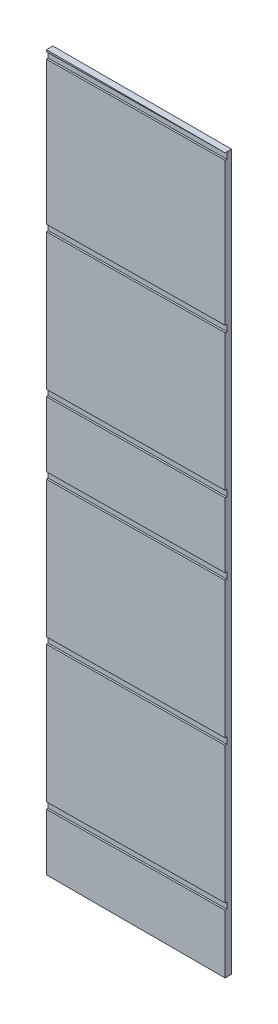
ISO-10303-21;
HEADER;
FILE_DESCRIPTION(('STEP AP214'),'2;1');
FILE_NAME('part.step','',(''),(''),'','','');
FILE_SCHEMA(('AUTOMOTIVE_DESIGN { 1 0 10303 214 1 1 1 1 }'));
ENDSEC;
DATA;
#1=APPLICATION_CONTEXT('core data for automotive mechanical design processes');
#2=APPLICATION_PROTOCOL_DEFINITION('international standard','automotive_design',2000,#1);
#3=PRODUCT_CONTEXT('',#1,'mechanical');
#4=PRODUCT('Part','Part','',(#3));
#5=PRODUCT_RELATED_PRODUCT_CATEGORY('part','',(#4));
#6=PRODUCT_DEFINITION_FORMATION('','',#4);
#7=PRODUCT_DEFINITION_CONTEXT('part definition',#1,'design');
#8=PRODUCT_DEFINITION('design','',#6,#7);
#9=PRODUCT_DEFINITION_SHAPE('','',#8);
#10=(LENGTH_UNIT() NAMED_UNIT(*) SI_UNIT(.MILLI.,.METRE.));
#11=(NAMED_UNIT(*) PLANE_ANGLE_UNIT() SI_UNIT($,.RADIAN.));
#12=(NAMED_UNIT(*) SI_UNIT($,.STERADIAN.) SOLID_ANGLE_UNIT());
#13=UNCERTAINTY_MEASURE_WITH_UNIT(LENGTH_MEASURE(1.E-05),#10,'distance_accuracy_value','');
#14=(GEOMETRIC_REPRESENTATION_CONTEXT(3) GLOBAL_UNCERTAINTY_ASSIGNED_CONTEXT((#13)) GLOBAL_UNIT_ASSIGNED_CONTEXT((#10,
#11,#12)) REPRESENTATION_CONTEXT('',''));
#15=CARTESIAN_POINT('',(0.,0.,0.));
#16=DIRECTION('',(0.,0.,1.));
#17=DIRECTION('',(1.,0.,0.));
#18=AXIS2_PLACEMENT_3D('',#15,#16,#17);
#19=CARTESIAN_POINT('',(0.,0.,18.));
#20=DIRECTION('',(0.,0.,1.));
#21=DIRECTION('',(1.,0.,0.));
#22=AXIS2_PLACEMENT_3D('',#19,#20,#21);
#23=PLANE('',#22);
#24=DIRECTION('',(0.999950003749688,0.00999950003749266,0.));
#25=VECTOR('',#24,1.);
#26=CARTESIAN_POINT('',(-249.999999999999,558.999999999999,18.));
#27=LINE('',#26,#25);
#28=CARTESIAN_POINT('',(-249.999999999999,558.999999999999,18.));
#29=VERTEX_POINT('',#28);
#30=CARTESIAN_POINT('',(250.000000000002,563.999999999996,18.));
#31=VERTEX_POINT('',#30);
#32=EDGE_CURVE('E230',#29,#31,#27,.T.);
#33=ORIENTED_EDGE('',*,*,#32,.F.);
#34=DIRECTION('',(0.,-1.,0.));
#35=VECTOR('',#34,1.);
#36=CARTESIAN_POINT('',(-249.999999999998,1000.,18.));
#37=LINE('',#36,#35);
#38=CARTESIAN_POINT('',(-249.999999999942,176.999999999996,18.));
#39=VERTEX_POINT('',#38);
#40=EDGE_CURVE('E427',#29,#39,#37,.T.);
#41=ORIENTED_EDGE('',*,*,#40,.T.);
#42=DIRECTION('',(-0.999950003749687,-0.00999950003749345,0.));
#43=VECTOR('',#42,1.);
#44=CARTESIAN_POINT('',(250.000000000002,181.999999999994,18.));
#45=LINE('',#44,#43);
#46=CARTESIAN_POINT('',(250.000000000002,181.999999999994,18.));
#47=VERTEX_POINT('',#46);
#48=EDGE_CURVE('E252',#47,#39,#45,.T.);
#49=ORIENTED_EDGE('',*,*,#48,.F.);
#50=DIRECTION('',(0.,1.,0.));
#51=VECTOR('',#50,1.);
#52=CARTESIAN_POINT('',(250.000000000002,1000.,18.));
#53=LINE('',#52,#51);
#54=EDGE_CURVE('E515',#47,#31,#53,.T.);
#55=ORIENTED_EDGE('',*,*,#54,.T.);
#56=EDGE_LOOP('',(#33,#41,#49,#55));
#57=FACE_BOUND('',#56,.T.);
#58=ADVANCED_FACE('F32',(#57),#23,.T.);
#59=DIRECTION('',(0.999950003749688,0.00999950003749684,0.));
#60=VECTOR('',#59,1.);
#61=CARTESIAN_POINT('',(-249.999999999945,158.999999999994,18.));
#62=LINE('',#61,#60);
#63=CARTESIAN_POINT('',(-249.999999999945,158.999999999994,18.));
#64=VERTEX_POINT('',#63);
#65=CARTESIAN_POINT('',(250.000000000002,163.999999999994,18.));
#66=VERTEX_POINT('',#65);
#67=EDGE_CURVE('E245',#64,#66,#62,.T.);
#68=ORIENTED_EDGE('',*,*,#67,.F.);
#69=CARTESIAN_POINT('',(-249.999999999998,-22.9999999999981,18.));
#70=VERTEX_POINT('',#69);
#71=EDGE_CURVE('E429',#64,#70,#37,.T.);
#72=ORIENTED_EDGE('',*,*,#71,.T.);
#73=DIRECTION('',(-0.999950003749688,-0.00999950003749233,0.));
#74=VECTOR('',#73,1.);
#75=CARTESIAN_POINT('',(250.000000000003,-18.0000000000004,18.));
#76=LINE('',#75,#74);
#77=CARTESIAN_POINT('',(250.000000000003,-18.0000000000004,18.));
#78=VERTEX_POINT('',#77);
#79=EDGE_CURVE('E278',#78,#70,#76,.T.);
#80=ORIENTED_EDGE('',*,*,#79,.F.);
#81=EDGE_CURVE('E512',#78,#66,#53,.T.);
#82=ORIENTED_EDGE('',*,*,#81,.T.);
#83=EDGE_LOOP('',(#68,#72,#80,#82));
#84=FACE_BOUND('',#83,.T.);
#85=ADVANCED_FACE('F464',(#84),#23,.T.);
#86=DIRECTION('',(0.999950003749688,0.00999950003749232,0.));
#87=VECTOR('',#86,1.);
#88=CARTESIAN_POINT('',(-249.999999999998,-40.9999999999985,18.));
#89=LINE('',#88,#87);
#90=CARTESIAN_POINT('',(-249.999999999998,-40.9999999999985,18.));
#91=VERTEX_POINT('',#90);
#92=CARTESIAN_POINT('',(250.000000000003,-36.0000000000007,18.));
#93=VERTEX_POINT('',#92);
#94=EDGE_CURVE('E270',#91,#93,#89,.T.);
#95=ORIENTED_EDGE('',*,*,#94,.F.);
#96=CARTESIAN_POINT('',(-249.999999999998,-423.000000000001,18.));
#97=VERTEX_POINT('',#96);
#98=EDGE_CURVE('E434',#91,#97,#37,.T.);
#99=ORIENTED_EDGE('',*,*,#98,.T.);
#100=DIRECTION('',(-0.999950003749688,-0.0099995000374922,0.));
#101=VECTOR('',#100,1.);
#102=CARTESIAN_POINT('',(250.000000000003,-418.000000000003,18.));
#103=LINE('',#102,#101);
#104=CARTESIAN_POINT('',(250.000000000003,-418.000000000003,18.));
#105=VERTEX_POINT('',#104);
#106=EDGE_CURVE('E302',#105,#97,#103,.T.);
#107=ORIENTED_EDGE('',*,*,#106,.F.);
#108=EDGE_CURVE('E510',#105,#93,#53,.T.);
#109=ORIENTED_EDGE('',*,*,#108,.T.);
#110=EDGE_LOOP('',(#95,#99,#107,#109));
#111=FACE_BOUND('',#110,.T.);
#112=ADVANCED_FACE('F470',(#111),#23,.T.);
#113=DIRECTION('',(0.999950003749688,0.0099995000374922,0.));
#114=VECTOR('',#113,1.);
#115=CARTESIAN_POINT('',(-249.999999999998,-441.000000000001,18.));
#116=LINE('',#115,#114);
#117=CARTESIAN_POINT('',(-249.999999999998,-441.000000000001,18.));
#118=VERTEX_POINT('',#117);
#119=CARTESIAN_POINT('',(250.000000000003,-436.000000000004,18.));
#120=VERTEX_POINT('',#119);
#121=EDGE_CURVE('E294',#118,#120,#116,.T.);
#122=ORIENTED_EDGE('',*,*,#121,.F.);
#123=CARTESIAN_POINT('',(-249.999999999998,-823.000000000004,18.));
#124=VERTEX_POINT('',#123);
#125=EDGE_CURVE('E440',#118,#124,#37,.T.);
#126=ORIENTED_EDGE('',*,*,#125,.T.);
#127=DIRECTION('',(-0.999950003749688,-0.00999950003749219,0.));
#128=VECTOR('',#127,1.);
#129=CARTESIAN_POINT('',(250.000000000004,-818.000000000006,18.));
#130=LINE('',#129,#128);
#131=CARTESIAN_POINT('',(250.000000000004,-818.000000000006,18.));
#132=VERTEX_POINT('',#131);
#133=EDGE_CURVE('E326',#132,#124,#130,.T.);
#134=ORIENTED_EDGE('',*,*,#133,.F.);
#135=EDGE_CURVE('E373',#132,#120,#53,.T.);
#136=ORIENTED_EDGE('',*,*,#135,.T.);
#137=EDGE_LOOP('',(#122,#126,#134,#136));
#138=FACE_BOUND('',#137,.T.);
#139=ADVANCED_FACE('F485',(#138),#23,.T.);
#140=DIRECTION('',(0.999950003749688,0.00999950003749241,0.));
#141=VECTOR('',#140,1.);
#142=CARTESIAN_POINT('',(-249.999999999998,-841.000000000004,18.));
#143=LINE('',#142,#141);
#144=CARTESIAN_POINT('',(-249.999999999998,-841.000000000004,18.));
#145=VERTEX_POINT('',#144);
#146=CARTESIAN_POINT('',(250.000000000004,-836.000000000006,18.));
#147=VERTEX_POINT('',#146);
#148=EDGE_CURVE('E318',#145,#147,#143,.T.);
#149=ORIENTED_EDGE('',*,*,#148,.F.);
#150=CARTESIAN_POINT('',(-249.999999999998,-1000.,18.));
#151=VERTEX_POINT('',#150);
#152=EDGE_CURVE('E367',#145,#151,#37,.T.);
#153=ORIENTED_EDGE('',*,*,#152,.T.);
#154=DIRECTION('',(1.,0.,0.));
#155=VECTOR('',#154,1.);
#156=CARTESIAN_POINT('',(-249.999999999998,-1000.,18.));
#157=LINE('',#156,#155);
#158=CARTESIAN_POINT('',(250.000000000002,-1000.,18.));
#159=VERTEX_POINT('',#158);
#160=EDGE_CURVE('E365',#151,#159,#157,.T.);
#161=ORIENTED_EDGE('',*,*,#160,.T.);
#162=EDGE_CURVE('E369',#159,#147,#53,.T.);
#163=ORIENTED_EDGE('',*,*,#162,.T.);
#164=EDGE_LOOP('',(#149,#153,#161,#163));
#165=FACE_BOUND('',#164,.T.);
#166=ADVANCED_FACE('F453',(#165),#23,.T.);
#167=DIRECTION('',(-0.999950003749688,-0.00999950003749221,0.));
#168=VECTOR('',#167,1.);
#169=CARTESIAN_POINT('',(250.000000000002,581.999999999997,18.));
#170=LINE('',#169,#168);
#171=CARTESIAN_POINT('',(250.000000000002,581.999999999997,18.));
#172=VERTEX_POINT('',#171);
#173=CARTESIAN_POINT('',(-249.999999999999,576.999999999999,18.));
#174=VERTEX_POINT('',#173);
#175=EDGE_CURVE('E259',#172,#174,#170,.T.);
#176=ORIENTED_EDGE('',*,*,#175,.F.);
#177=CARTESIAN_POINT('',(250.000000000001,982.,18.));
#178=VERTEX_POINT('',#177);
#179=EDGE_CURVE('E235',#172,#178,#53,.T.);
#180=ORIENTED_EDGE('',*,*,#179,.T.);
#181=DIRECTION('',(0.999950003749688,0.00999950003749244,0.));
#182=VECTOR('',#181,1.);
#183=CARTESIAN_POINT('',(-249.999999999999,977.000000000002,18.));
#184=LINE('',#183,#182);
#185=CARTESIAN_POINT('',(-249.999999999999,977.000000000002,18.));
#186=VERTEX_POINT('',#185);
#187=EDGE_CURVE('E341',#186,#178,#184,.T.);
#188=ORIENTED_EDGE('',*,*,#187,.F.);
#189=EDGE_CURVE('E366',#186,#174,#37,.T.);
#190=ORIENTED_EDGE('',*,*,#189,.T.);
#191=EDGE_LOOP('',(#176,#180,#188,#190));
#192=FACE_BOUND('',#191,.T.);
#193=ADVANCED_FACE('F426',(#192),#23,.T.);
#194=CARTESIAN_POINT('',(-249.999999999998,1000.,18.));
#195=DIRECTION('',(1.,0.,0.));
#196=DIRECTION('',(0.,0.,-1.));
#197=AXIS2_PLACEMENT_3D('',#194,#195,#196);
#198=PLANE('',#197);
#199=ORIENTED_EDGE('',*,*,#40,.F.);
#200=DIRECTION('',(0.,0.,1.));
#201=VECTOR('',#200,1.);
#202=CARTESIAN_POINT('',(-249.999999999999,558.999999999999,13.));
#203=LINE('',#202,#201);
#204=CARTESIAN_POINT('',(-249.999999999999,558.999999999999,13.));
#205=VERTEX_POINT('',#204);
#206=EDGE_CURVE('E237',#205,#29,#203,.T.);
#207=ORIENTED_EDGE('',*,*,#206,.F.);
#208=DIRECTION('',(0.,-1.,0.));
#209=VECTOR('',#208,1.);
#210=CARTESIAN_POINT('',(-249.999999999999,576.999999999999,13.));
#211=LINE('',#210,#209);
#212=CARTESIAN_POINT('',(-249.999999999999,576.999999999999,13.));
#213=VERTEX_POINT('',#212);
#214=EDGE_CURVE('E223',#213,#205,#211,.T.);
#215=ORIENTED_EDGE('',*,*,#214,.F.);
#216=DIRECTION('',(0.,0.,1.));
#217=VECTOR('',#216,1.);
#218=CARTESIAN_POINT('',(-249.999999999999,576.999999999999,13.));
#219=LINE('',#218,#217);
#220=EDGE_CURVE('E221',#213,#174,#219,.T.);
#221=ORIENTED_EDGE('',*,*,#220,.T.);
#222=ORIENTED_EDGE('',*,*,#189,.F.);
#223=DIRECTION('',(0.,0.,1.));
#224=VECTOR('',#223,1.);
#225=CARTESIAN_POINT('',(-249.999999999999,977.000000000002,13.));
#226=LINE('',#225,#224);
#227=CARTESIAN_POINT('',(-249.999999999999,977.000000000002,13.));
#228=VERTEX_POINT('',#227);
#229=EDGE_CURVE('E358',#228,#186,#226,.T.);
#230=ORIENTED_EDGE('',*,*,#229,.F.);
#231=DIRECTION('',(0.,-1.,0.));
#232=VECTOR('',#231,1.);
#233=CARTESIAN_POINT('',(-250.,995.000000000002,13.));
#234=LINE('',#233,#232);
#235=CARTESIAN_POINT('',(-250.,995.000000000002,13.));
#236=VERTEX_POINT('',#235);
#237=EDGE_CURVE('E344',#236,#228,#234,.T.);
#238=ORIENTED_EDGE('',*,*,#237,.F.);
#239=DIRECTION('',(0.,0.,1.));
#240=VECTOR('',#239,1.);
#241=CARTESIAN_POINT('',(-250.,995.000000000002,13.));
#242=LINE('',#241,#240);
#243=CARTESIAN_POINT('',(-250.,995.000000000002,18.));
#244=VERTEX_POINT('',#243);
#245=EDGE_CURVE('E349',#236,#244,#242,.T.);
#246=ORIENTED_EDGE('',*,*,#245,.T.);
#247=CARTESIAN_POINT('',(-249.999999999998,1000.,18.));
#248=VERTEX_POINT('',#247);
#249=EDGE_CURVE('E362',#248,#244,#37,.T.);
#250=ORIENTED_EDGE('',*,*,#249,.F.);
#251=DIRECTION('',(0.,0.,-1.));
#252=VECTOR('',#251,1.);
#253=CARTESIAN_POINT('',(-249.999999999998,1000.,18.));
#254=LINE('',#253,#252);
#255=CARTESIAN_POINT('',(-249.999999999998,1000.,0.));
#256=VERTEX_POINT('',#255);
#257=EDGE_CURVE('E375',#248,#256,#254,.T.);
#258=ORIENTED_EDGE('',*,*,#257,.T.);
#259=DIRECTION('',(0.,-1.,0.));
#260=VECTOR('',#259,1.);
#261=CARTESIAN_POINT('',(-249.999999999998,1000.,0.));
#262=LINE('',#261,#260);
#263=CARTESIAN_POINT('',(-249.999999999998,-1000.,0.));
#264=VERTEX_POINT('',#263);
#265=EDGE_CURVE('E357',#256,#264,#262,.T.);
#266=ORIENTED_EDGE('',*,*,#265,.T.);
#267=DIRECTION('',(0.,0.,-1.));
#268=VECTOR('',#267,1.);
#269=CARTESIAN_POINT('',(-249.999999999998,-1000.,18.));
#270=LINE('',#269,#268);
#271=EDGE_CURVE('E11',#151,#264,#270,.T.);
#272=ORIENTED_EDGE('',*,*,#271,.F.);
#273=ORIENTED_EDGE('',*,*,#152,.F.);
#274=DIRECTION('',(0.,0.,1.));
#275=VECTOR('',#274,1.);
#276=CARTESIAN_POINT('',(-249.999999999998,-841.000000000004,13.));
#277=LINE('',#276,#275);
#278=CARTESIAN_POINT('',(-249.999999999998,-841.000000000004,13.));
#279=VERTEX_POINT('',#278);
#280=EDGE_CURVE('E331',#279,#145,#277,.T.);
#281=ORIENTED_EDGE('',*,*,#280,.F.);
#282=DIRECTION('',(0.,-1.,0.));
#283=VECTOR('',#282,1.);
#284=CARTESIAN_POINT('',(-249.999999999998,-823.000000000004,13.));
#285=LINE('',#284,#283);
#286=CARTESIAN_POINT('',(-249.999999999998,-823.000000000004,13.));
#287=VERTEX_POINT('',#286);
#288=EDGE_CURVE('E321',#287,#279,#285,.T.);
#289=ORIENTED_EDGE('',*,*,#288,.F.);
#290=DIRECTION('',(0.,0.,1.));
#291=VECTOR('',#290,1.);
#292=CARTESIAN_POINT('',(-249.999999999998,-823.000000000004,13.));
#293=LINE('',#292,#291);
#294=EDGE_CURVE('E333',#287,#124,#293,.T.);
#295=ORIENTED_EDGE('',*,*,#294,.T.);
#296=ORIENTED_EDGE('',*,*,#125,.F.);
#297=DIRECTION('',(0.,0.,1.));
#298=VECTOR('',#297,1.);
#299=CARTESIAN_POINT('',(-249.999999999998,-441.000000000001,13.));
#300=LINE('',#299,#298);
#301=CARTESIAN_POINT('',(-249.999999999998,-441.000000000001,13.));
#302=VERTEX_POINT('',#301);
#303=EDGE_CURVE('E308',#302,#118,#300,.T.);
#304=ORIENTED_EDGE('',*,*,#303,.F.);
#305=DIRECTION('',(0.,-1.,0.));
#306=VECTOR('',#305,1.);
#307=CARTESIAN_POINT('',(-249.999999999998,-423.000000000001,13.));
#308=LINE('',#307,#306);
#309=CARTESIAN_POINT('',(-249.999999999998,-423.000000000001,13.));
#310=VERTEX_POINT('',#309);
#311=EDGE_CURVE('E297',#310,#302,#308,.T.);
#312=ORIENTED_EDGE('',*,*,#311,.F.);
#313=DIRECTION('',(0.,0.,1.));
#314=VECTOR('',#313,1.);
#315=CARTESIAN_POINT('',(-249.999999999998,-423.000000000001,13.));
#316=LINE('',#315,#314);
#317=EDGE_CURVE('E310',#310,#97,#316,.T.);
#318=ORIENTED_EDGE('',*,*,#317,.T.);
#319=ORIENTED_EDGE('',*,*,#98,.F.);
#320=DIRECTION('',(0.,0.,1.));
#321=VECTOR('',#320,1.);
#322=CARTESIAN_POINT('',(-249.999999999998,-40.9999999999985,13.));
#323=LINE('',#322,#321);
#324=CARTESIAN_POINT('',(-249.999999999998,-40.9999999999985,13.));
#325=VERTEX_POINT('',#324);
#326=EDGE_CURVE('E284',#325,#91,#323,.T.);
#327=ORIENTED_EDGE('',*,*,#326,.F.);
#328=DIRECTION('',(0.,-1.,0.));
#329=VECTOR('',#328,1.);
#330=CARTESIAN_POINT('',(-249.999999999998,-22.9999999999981,13.));
#331=LINE('',#330,#329);
#332=CARTESIAN_POINT('',(-249.999999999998,-22.9999999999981,13.));
#333=VERTEX_POINT('',#332);
#334=EDGE_CURVE('E273',#333,#325,#331,.T.);
#335=ORIENTED_EDGE('',*,*,#334,.F.);
#336=DIRECTION('',(0.,0.,1.));
#337=VECTOR('',#336,1.);
#338=CARTESIAN_POINT('',(-249.999999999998,-22.9999999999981,13.));
#339=LINE('',#338,#337);
#340=EDGE_CURVE('E286',#333,#70,#339,.T.);
#341=ORIENTED_EDGE('',*,*,#340,.T.);
#342=ORIENTED_EDGE('',*,*,#71,.F.);
#343=DIRECTION('',(0.,0.,1.));
#344=VECTOR('',#343,1.);
#345=CARTESIAN_POINT('',(-249.999999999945,158.999999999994,13.));
#346=LINE('',#345,#344);
#347=CARTESIAN_POINT('',(-249.999999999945,158.999999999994,13.));
#348=VERTEX_POINT('',#347);
#349=EDGE_CURVE('E260',#348,#64,#346,.T.);
#350=ORIENTED_EDGE('',*,*,#349,.F.);
#351=DIRECTION('',(-1.54197642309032E-13,-1.,0.));
#352=VECTOR('',#351,1.);
#353=CARTESIAN_POINT('',(-249.999999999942,176.999999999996,13.));
#354=LINE('',#353,#352);
#355=CARTESIAN_POINT('',(-249.999999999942,176.999999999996,13.));
#356=VERTEX_POINT('',#355);
#357=EDGE_CURVE('E248',#356,#348,#354,.T.);
#358=ORIENTED_EDGE('',*,*,#357,.F.);
#359=DIRECTION('',(0.,0.,1.));
#360=VECTOR('',#359,1.);
#361=CARTESIAN_POINT('',(-249.999999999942,176.999999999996,13.));
#362=LINE('',#361,#360);
#363=EDGE_CURVE('E262',#356,#39,#362,.T.);
#364=ORIENTED_EDGE('',*,*,#363,.T.);
#365=EDGE_LOOP('',(#199,#207,#215,#221,#222,#230,#238,#246,#250,#258,#266,#272,#273,#281,#289,
#295,#296,#304,#312,#318,#319,#327,#335,#341,#342,#350,#358,#364));
#366=FACE_BOUND('',#365,.T.);
#367=ADVANCED_FACE('F34',(#366),#198,.F.);
#368=CARTESIAN_POINT('',(-249.999999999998,-1000.,18.));
#369=DIRECTION('',(0.,1.,0.));
#370=DIRECTION('',(0.,0.,1.));
#371=AXIS2_PLACEMENT_3D('',#368,#369,#370);
#372=PLANE('',#371);
#373=DIRECTION('',(1.,0.,0.));
#374=VECTOR('',#373,1.);
#375=CARTESIAN_POINT('',(-249.999999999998,-1000.,0.));
#376=LINE('',#375,#374);
#377=CARTESIAN_POINT('',(250.000000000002,-1000.,0.));
#378=VERTEX_POINT('',#377);
#379=EDGE_CURVE('E378',#264,#378,#376,.T.);
#380=ORIENTED_EDGE('',*,*,#379,.T.);
#381=DIRECTION('',(0.,0.,-1.));
#382=VECTOR('',#381,1.);
#383=CARTESIAN_POINT('',(250.000000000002,-1000.,18.));
#384=LINE('',#383,#382);
#385=EDGE_CURVE('E40',#159,#378,#384,.T.);
#386=ORIENTED_EDGE('',*,*,#385,.F.);
#387=ORIENTED_EDGE('',*,*,#160,.F.);
#388=ORIENTED_EDGE('',*,*,#271,.T.);
#389=EDGE_LOOP('',(#380,#386,#387,#388));
#390=FACE_BOUND('',#389,.T.);
#391=ADVANCED_FACE('F455',(#390),#372,.F.);
#392=CARTESIAN_POINT('',(250.000000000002,1000.,18.));
#393=DIRECTION('',(-1.,0.,0.));
#394=DIRECTION('',(0.,0.,1.));
#395=AXIS2_PLACEMENT_3D('',#392,#393,#394);
#396=PLANE('',#395);
#397=DIRECTION('',(0.,1.,0.));
#398=VECTOR('',#397,1.);
#399=CARTESIAN_POINT('',(250.000000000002,563.999999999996,13.));
#400=LINE('',#399,#398);
#401=CARTESIAN_POINT('',(250.000000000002,563.999999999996,13.));
#402=VERTEX_POINT('',#401);
#403=CARTESIAN_POINT('',(250.000000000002,581.999999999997,13.));
#404=VERTEX_POINT('',#403);
#405=EDGE_CURVE('E224',#402,#404,#400,.T.);
#406=ORIENTED_EDGE('',*,*,#405,.F.);
#407=DIRECTION('',(0.,0.,1.));
#408=VECTOR('',#407,1.);
#409=CARTESIAN_POINT('',(250.000000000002,563.999999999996,13.));
#410=LINE('',#409,#408);
#411=EDGE_CURVE('E352',#402,#31,#410,.T.);
#412=ORIENTED_EDGE('',*,*,#411,.T.);
#413=ORIENTED_EDGE('',*,*,#54,.F.);
#414=DIRECTION('',(0.,0.,1.));
#415=VECTOR('',#414,1.);
#416=CARTESIAN_POINT('',(250.000000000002,181.999999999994,13.));
#417=LINE('',#416,#415);
#418=CARTESIAN_POINT('',(250.000000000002,181.999999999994,13.));
#419=VERTEX_POINT('',#418);
#420=EDGE_CURVE('E251',#419,#47,#417,.T.);
#421=ORIENTED_EDGE('',*,*,#420,.F.);
#422=DIRECTION('',(0.,1.,0.));
#423=VECTOR('',#422,1.);
#424=CARTESIAN_POINT('',(250.000000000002,163.999999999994,13.));
#425=LINE('',#424,#423);
#426=CARTESIAN_POINT('',(250.000000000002,163.999999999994,13.));
#427=VERTEX_POINT('',#426);
#428=EDGE_CURVE('E242',#427,#419,#425,.T.);
#429=ORIENTED_EDGE('',*,*,#428,.F.);
#430=DIRECTION('',(0.,0.,1.));
#431=VECTOR('',#430,1.);
#432=CARTESIAN_POINT('',(250.000000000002,163.999999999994,13.));
#433=LINE('',#432,#431);
#434=EDGE_CURVE('E256',#427,#66,#433,.T.);
#435=ORIENTED_EDGE('',*,*,#434,.T.);
#436=ORIENTED_EDGE('',*,*,#81,.F.);
#437=DIRECTION('',(0.,0.,1.));
#438=VECTOR('',#437,1.);
#439=CARTESIAN_POINT('',(250.000000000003,-18.0000000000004,13.));
#440=LINE('',#439,#438);
#441=CARTESIAN_POINT('',(250.000000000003,-18.0000000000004,13.));
#442=VERTEX_POINT('',#441);
#443=EDGE_CURVE('E277',#442,#78,#440,.T.);
#444=ORIENTED_EDGE('',*,*,#443,.F.);
#445=DIRECTION('',(0.,1.,0.));
#446=VECTOR('',#445,1.);
#447=CARTESIAN_POINT('',(250.000000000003,-36.0000000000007,13.));
#448=LINE('',#447,#446);
#449=CARTESIAN_POINT('',(250.000000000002,-36.0000000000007,13.));
#450=VERTEX_POINT('',#449);
#451=EDGE_CURVE('E266',#450,#442,#448,.T.);
#452=ORIENTED_EDGE('',*,*,#451,.F.);
#453=DIRECTION('',(0.,0.,1.));
#454=VECTOR('',#453,1.);
#455=CARTESIAN_POINT('',(250.000000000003,-36.0000000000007,13.));
#456=LINE('',#455,#454);
#457=EDGE_CURVE('E254',#450,#93,#456,.T.);
#458=ORIENTED_EDGE('',*,*,#457,.T.);
#459=ORIENTED_EDGE('',*,*,#108,.F.);
#460=DIRECTION('',(0.,0.,1.));
#461=VECTOR('',#460,1.);
#462=CARTESIAN_POINT('',(250.000000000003,-418.000000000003,13.));
#463=LINE('',#462,#461);
#464=CARTESIAN_POINT('',(250.000000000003,-418.000000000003,13.));
#465=VERTEX_POINT('',#464);
#466=EDGE_CURVE('E301',#465,#105,#463,.T.);
#467=ORIENTED_EDGE('',*,*,#466,.F.);
#468=DIRECTION('',(0.,1.,0.));
#469=VECTOR('',#468,1.);
#470=CARTESIAN_POINT('',(250.000000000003,-436.000000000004,13.));
#471=LINE('',#470,#469);
#472=CARTESIAN_POINT('',(250.000000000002,-436.000000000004,13.));
#473=VERTEX_POINT('',#472);
#474=EDGE_CURVE('E290',#473,#465,#471,.T.);
#475=ORIENTED_EDGE('',*,*,#474,.F.);
#476=DIRECTION('',(0.,0.,1.));
#477=VECTOR('',#476,1.);
#478=CARTESIAN_POINT('',(250.000000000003,-436.000000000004,13.));
#479=LINE('',#478,#477);
#480=EDGE_CURVE('E280',#473,#120,#479,.T.);
#481=ORIENTED_EDGE('',*,*,#480,.T.);
#482=ORIENTED_EDGE('',*,*,#135,.F.);
#483=DIRECTION('',(0.,0.,1.));
#484=VECTOR('',#483,1.);
#485=CARTESIAN_POINT('',(250.000000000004,-818.000000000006,13.));
#486=LINE('',#485,#484);
#487=CARTESIAN_POINT('',(250.000000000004,-818.000000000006,13.));
#488=VERTEX_POINT('',#487);
#489=EDGE_CURVE('E325',#488,#132,#486,.T.);
#490=ORIENTED_EDGE('',*,*,#489,.F.);
#491=DIRECTION('',(0.,1.,0.));
#492=VECTOR('',#491,1.);
#493=CARTESIAN_POINT('',(250.000000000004,-836.000000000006,13.));
#494=LINE('',#493,#492);
#495=CARTESIAN_POINT('',(250.000000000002,-836.000000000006,13.));
#496=VERTEX_POINT('',#495);
#497=EDGE_CURVE('E314',#496,#488,#494,.T.);
#498=ORIENTED_EDGE('',*,*,#497,.F.);
#499=DIRECTION('',(0.,0.,1.));
#500=VECTOR('',#499,1.);
#501=CARTESIAN_POINT('',(250.000000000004,-836.000000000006,13.));
#502=LINE('',#501,#500);
#503=EDGE_CURVE('E304',#496,#147,#502,.T.);
#504=ORIENTED_EDGE('',*,*,#503,.T.);
#505=ORIENTED_EDGE('',*,*,#162,.F.);
#506=ORIENTED_EDGE('',*,*,#385,.T.);
#507=DIRECTION('',(0.,1.,0.));
#508=VECTOR('',#507,1.);
#509=CARTESIAN_POINT('',(250.000000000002,1000.,0.));
#510=LINE('',#509,#508);
#511=CARTESIAN_POINT('',(250.000000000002,1000.,0.));
#512=VERTEX_POINT('',#511);
#513=EDGE_CURVE('E380',#378,#512,#510,.T.);
#514=ORIENTED_EDGE('',*,*,#513,.T.);
#515=DIRECTION('',(0.,0.,-1.));
#516=VECTOR('',#515,1.);
#517=CARTESIAN_POINT('',(250.000000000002,1000.,18.));
#518=LINE('',#517,#516);
#519=CARTESIAN_POINT('',(250.000000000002,1000.,13.));
#520=VERTEX_POINT('',#519);
#521=EDGE_CURVE('E387',#520,#512,#518,.T.);
#522=ORIENTED_EDGE('',*,*,#521,.F.);
#523=DIRECTION('',(0.,1.,0.));
#524=VECTOR('',#523,1.);
#525=CARTESIAN_POINT('',(250.000000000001,982.,13.));
#526=LINE('',#525,#524);
#527=CARTESIAN_POINT('',(250.000000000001,982.,13.));
#528=VERTEX_POINT('',#527);
#529=EDGE_CURVE('E337',#528,#520,#526,.T.);
#530=ORIENTED_EDGE('',*,*,#529,.F.);
#531=DIRECTION('',(0.,0.,1.));
#532=VECTOR('',#531,1.);
#533=CARTESIAN_POINT('',(250.000000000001,982.,13.));
#534=LINE('',#533,#532);
#535=EDGE_CURVE('E355',#528,#178,#534,.T.);
#536=ORIENTED_EDGE('',*,*,#535,.T.);
#537=ORIENTED_EDGE('',*,*,#179,.F.);
#538=DIRECTION('',(0.,0.,1.));
#539=VECTOR('',#538,1.);
#540=CARTESIAN_POINT('',(250.000000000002,581.999999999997,13.));
#541=LINE('',#540,#539);
#542=EDGE_CURVE('E218',#404,#172,#541,.T.);
#543=ORIENTED_EDGE('',*,*,#542,.F.);
#544=EDGE_LOOP('',(#406,#412,#413,#421,#429,#435,#436,#444,#452,#458,#459,#467,#475,#481,#482,
#490,#498,#504,#505,#506,#514,#522,#530,#536,#537,#543));
#545=FACE_BOUND('',#544,.T.);
#546=ADVANCED_FACE('F233',(#545),#396,.F.);
#547=CARTESIAN_POINT('',(-249.999999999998,1000.,18.));
#548=DIRECTION('',(0.,-1.,0.));
#549=DIRECTION('',(0.,0.,-1.));
#550=AXIS2_PLACEMENT_3D('',#547,#548,#549);
#551=PLANE('',#550);
#552=DIRECTION('',(-1.,0.,0.));
#553=VECTOR('',#552,1.);
#554=CARTESIAN_POINT('',(-249.999999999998,1000.,0.));
#555=LINE('',#554,#553);
#556=EDGE_CURVE('E383',#512,#256,#555,.T.);
#557=ORIENTED_EDGE('',*,*,#556,.T.);
#558=ORIENTED_EDGE('',*,*,#257,.F.);
#559=DIRECTION('',(-1.,0.,0.));
#560=VECTOR('',#559,1.);
#561=CARTESIAN_POINT('',(-249.999999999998,1000.,18.));
#562=LINE('',#561,#560);
#563=CARTESIAN_POINT('',(250.000000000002,1000.,18.));
#564=VERTEX_POINT('',#563);
#565=EDGE_CURVE('E372',#564,#248,#562,.T.);
#566=ORIENTED_EDGE('',*,*,#565,.F.);
#567=EDGE_CURVE('E388',#564,#520,#518,.T.);
#568=ORIENTED_EDGE('',*,*,#567,.T.);
#569=ORIENTED_EDGE('',*,*,#521,.T.);
#570=EDGE_LOOP('',(#557,#558,#566,#568,#569));
#571=FACE_BOUND('',#570,.T.);
#572=ADVANCED_FACE('F403',(#571),#551,.F.);
#573=DIRECTION('',(-0.999950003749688,-0.0099995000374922,0.));
#574=VECTOR('',#573,1.);
#575=CARTESIAN_POINT('',(250.000000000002,1000.,18.));
#576=LINE('',#575,#574);
#577=EDGE_CURVE('E350',#564,#244,#576,.T.);
#578=ORIENTED_EDGE('',*,*,#577,.F.);
#579=ORIENTED_EDGE('',*,*,#565,.T.);
#580=ORIENTED_EDGE('',*,*,#249,.T.);
#581=EDGE_LOOP('',(#578,#579,#580));
#582=FACE_BOUND('',#581,.T.);
#583=ADVANCED_FACE('F412',(#582),#23,.T.);
#584=CARTESIAN_POINT('',(0.,0.,0.));
#585=DIRECTION('',(0.,0.,1.));
#586=DIRECTION('',(1.,0.,0.));
#587=AXIS2_PLACEMENT_3D('',#584,#585,#586);
#588=PLANE('',#587);
#589=ORIENTED_EDGE('',*,*,#265,.F.);
#590=ORIENTED_EDGE('',*,*,#556,.F.);
#591=ORIENTED_EDGE('',*,*,#513,.F.);
#592=ORIENTED_EDGE('',*,*,#379,.F.);
#593=EDGE_LOOP('',(#589,#590,#591,#592));
#594=FACE_BOUND('',#593,.T.);
#595=ADVANCED_FACE('F400',(#594),#588,.F.);
#596=CARTESIAN_POINT('',(-249.999999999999,977.000000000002,13.));
#597=DIRECTION('',(0.00999950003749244,-0.999950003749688,0.));
#598=DIRECTION('',(0.999950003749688,0.00999950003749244,0.));
#599=AXIS2_PLACEMENT_3D('',#596,#597,#598);
#600=PLANE('',#599);
#601=ORIENTED_EDGE('',*,*,#187,.T.);
#602=ORIENTED_EDGE('',*,*,#535,.F.);
#603=DIRECTION('',(0.999950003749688,0.00999950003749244,0.));
#604=VECTOR('',#603,1.);
#605=CARTESIAN_POINT('',(-249.999999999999,977.000000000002,13.));
#606=LINE('',#605,#604);
#607=EDGE_CURVE('E346',#228,#528,#606,.T.);
#608=ORIENTED_EDGE('',*,*,#607,.F.);
#609=ORIENTED_EDGE('',*,*,#229,.T.);
#610=EDGE_LOOP('',(#601,#602,#608,#609));
#611=FACE_BOUND('',#610,.T.);
#612=ADVANCED_FACE('F420',(#611),#600,.F.);
#613=CARTESIAN_POINT('',(250.000000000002,1000.,13.));
#614=DIRECTION('',(-0.0099995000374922,0.999950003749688,0.));
#615=DIRECTION('',(-0.999950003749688,-0.0099995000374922,0.));
#616=AXIS2_PLACEMENT_3D('',#613,#614,#615);
#617=PLANE('',#616);
#618=ORIENTED_EDGE('',*,*,#577,.T.);
#619=ORIENTED_EDGE('',*,*,#245,.F.);
#620=DIRECTION('',(-0.999950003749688,-0.0099995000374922,0.));
#621=VECTOR('',#620,1.);
#622=CARTESIAN_POINT('',(250.000000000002,1000.,13.));
#623=LINE('',#622,#621);
#624=EDGE_CURVE('E340',#520,#236,#623,.T.);
#625=ORIENTED_EDGE('',*,*,#624,.F.);
#626=ORIENTED_EDGE('',*,*,#567,.F.);
#627=EDGE_LOOP('',(#618,#619,#625,#626));
#628=FACE_BOUND('',#627,.T.);
#629=ADVANCED_FACE('F414',(#628),#617,.F.);
#630=CARTESIAN_POINT('',(0.,0.,13.));
#631=DIRECTION('',(0.,0.,1.));
#632=DIRECTION('',(1.,0.,0.));
#633=AXIS2_PLACEMENT_3D('',#630,#631,#632);
#634=PLANE('',#633);
#635=ORIENTED_EDGE('',*,*,#529,.T.);
#636=ORIENTED_EDGE('',*,*,#624,.T.);
#637=ORIENTED_EDGE('',*,*,#237,.T.);
#638=ORIENTED_EDGE('',*,*,#607,.T.);
#639=EDGE_LOOP('',(#635,#636,#637,#638));
#640=FACE_BOUND('',#639,.T.);
#641=ADVANCED_FACE('F417',(#640),#634,.T.);
#642=CARTESIAN_POINT('',(-249.999999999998,-841.000000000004,13.));
#643=DIRECTION('',(0.00999950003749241,-0.999950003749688,0.));
#644=DIRECTION('',(0.999950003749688,0.00999950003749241,0.));
#645=AXIS2_PLACEMENT_3D('',#642,#643,#644);
#646=PLANE('',#645);
#647=ORIENTED_EDGE('',*,*,#148,.T.);
#648=ORIENTED_EDGE('',*,*,#503,.F.);
#649=DIRECTION('',(0.999950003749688,0.00999950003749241,0.));
#650=VECTOR('',#649,1.);
#651=CARTESIAN_POINT('',(-249.999999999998,-841.000000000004,13.));
#652=LINE('',#651,#650);
#653=EDGE_CURVE('E323',#279,#496,#652,.T.);
#654=ORIENTED_EDGE('',*,*,#653,.F.);
#655=ORIENTED_EDGE('',*,*,#280,.T.);
#656=EDGE_LOOP('',(#647,#648,#654,#655));
#657=FACE_BOUND('',#656,.T.);
#658=ADVANCED_FACE('F565',(#657),#646,.F.);
#659=CARTESIAN_POINT('',(250.000000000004,-818.000000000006,13.));
#660=DIRECTION('',(-0.00999950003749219,0.999950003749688,0.));
#661=DIRECTION('',(-0.999950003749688,-0.00999950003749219,0.));
#662=AXIS2_PLACEMENT_3D('',#659,#660,#661);
#663=PLANE('',#662);
#664=ORIENTED_EDGE('',*,*,#133,.T.);
#665=ORIENTED_EDGE('',*,*,#294,.F.);
#666=DIRECTION('',(-0.999950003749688,-0.00999950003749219,0.));
#667=VECTOR('',#666,1.);
#668=CARTESIAN_POINT('',(250.000000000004,-818.000000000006,13.));
#669=LINE('',#668,#667);
#670=EDGE_CURVE('E317',#488,#287,#669,.T.);
#671=ORIENTED_EDGE('',*,*,#670,.F.);
#672=ORIENTED_EDGE('',*,*,#489,.T.);
#673=EDGE_LOOP('',(#664,#665,#671,#672));
#674=FACE_BOUND('',#673,.T.);
#675=ADVANCED_FACE('F502',(#674),#663,.F.);
#676=CARTESIAN_POINT('',(0.,0.,13.));
#677=DIRECTION('',(0.,0.,1.));
#678=DIRECTION('',(1.,0.,0.));
#679=AXIS2_PLACEMENT_3D('',#676,#677,#678);
#680=PLANE('',#679);
#681=ORIENTED_EDGE('',*,*,#497,.T.);
#682=ORIENTED_EDGE('',*,*,#670,.T.);
#683=ORIENTED_EDGE('',*,*,#288,.T.);
#684=ORIENTED_EDGE('',*,*,#653,.T.);
#685=EDGE_LOOP('',(#681,#682,#683,#684));
#686=FACE_BOUND('',#685,.T.);
#687=ADVANCED_FACE('F504',(#686),#680,.T.);
#688=CARTESIAN_POINT('',(-249.999999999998,-441.000000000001,13.));
#689=DIRECTION('',(0.0099995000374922,-0.999950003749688,0.));
#690=DIRECTION('',(0.999950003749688,0.0099995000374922,0.));
#691=AXIS2_PLACEMENT_3D('',#688,#689,#690);
#692=PLANE('',#691);
#693=ORIENTED_EDGE('',*,*,#121,.T.);
#694=ORIENTED_EDGE('',*,*,#480,.F.);
#695=DIRECTION('',(0.999950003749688,0.0099995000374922,0.));
#696=VECTOR('',#695,1.);
#697=CARTESIAN_POINT('',(-249.999999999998,-441.000000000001,13.));
#698=LINE('',#697,#696);
#699=EDGE_CURVE('E299',#302,#473,#698,.T.);
#700=ORIENTED_EDGE('',*,*,#699,.F.);
#701=ORIENTED_EDGE('',*,*,#303,.T.);
#702=EDGE_LOOP('',(#693,#694,#700,#701));
#703=FACE_BOUND('',#702,.T.);
#704=ADVANCED_FACE('F553',(#703),#692,.F.);
#705=CARTESIAN_POINT('',(250.000000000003,-418.000000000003,13.));
#706=DIRECTION('',(-0.0099995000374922,0.999950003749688,0.));
#707=DIRECTION('',(-0.999950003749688,-0.0099995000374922,0.));
#708=AXIS2_PLACEMENT_3D('',#705,#706,#707);
#709=PLANE('',#708);
#710=ORIENTED_EDGE('',*,*,#106,.T.);
#711=ORIENTED_EDGE('',*,*,#317,.F.);
#712=DIRECTION('',(-0.999950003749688,-0.0099995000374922,0.));
#713=VECTOR('',#712,1.);
#714=CARTESIAN_POINT('',(250.000000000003,-418.000000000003,13.));
#715=LINE('',#714,#713);
#716=EDGE_CURVE('E293',#465,#310,#715,.T.);
#717=ORIENTED_EDGE('',*,*,#716,.F.);
#718=ORIENTED_EDGE('',*,*,#466,.T.);
#719=EDGE_LOOP('',(#710,#711,#717,#718));
#720=FACE_BOUND('',#719,.T.);
#721=ADVANCED_FACE('F549',(#720),#709,.F.);
#722=CARTESIAN_POINT('',(0.,0.,13.));
#723=DIRECTION('',(0.,0.,1.));
#724=DIRECTION('',(1.,0.,0.));
#725=AXIS2_PLACEMENT_3D('',#722,#723,#724);
#726=PLANE('',#725);
#727=ORIENTED_EDGE('',*,*,#474,.T.);
#728=ORIENTED_EDGE('',*,*,#716,.T.);
#729=ORIENTED_EDGE('',*,*,#311,.T.);
#730=ORIENTED_EDGE('',*,*,#699,.T.);
#731=EDGE_LOOP('',(#727,#728,#729,#730));
#732=FACE_BOUND('',#731,.T.);
#733=ADVANCED_FACE('F551',(#732),#726,.T.);
#734=CARTESIAN_POINT('',(-249.999999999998,-40.9999999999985,13.));
#735=DIRECTION('',(0.00999950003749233,-0.999950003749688,0.));
#736=DIRECTION('',(0.999950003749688,0.00999950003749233,0.));
#737=AXIS2_PLACEMENT_3D('',#734,#735,#736);
#738=PLANE('',#737);
#739=ORIENTED_EDGE('',*,*,#94,.T.);
#740=ORIENTED_EDGE('',*,*,#457,.F.);
#741=DIRECTION('',(0.999950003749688,0.00999950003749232,0.));
#742=VECTOR('',#741,1.);
#743=CARTESIAN_POINT('',(-249.999999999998,-40.9999999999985,13.));
#744=LINE('',#743,#742);
#745=EDGE_CURVE('E275',#325,#450,#744,.T.);
#746=ORIENTED_EDGE('',*,*,#745,.F.);
#747=ORIENTED_EDGE('',*,*,#326,.T.);
#748=EDGE_LOOP('',(#739,#740,#746,#747));
#749=FACE_BOUND('',#748,.T.);
#750=ADVANCED_FACE('F547',(#749),#738,.F.);
#751=CARTESIAN_POINT('',(250.000000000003,-18.0000000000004,13.));
#752=DIRECTION('',(-0.00999950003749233,0.999950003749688,0.));
#753=DIRECTION('',(-0.999950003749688,-0.00999950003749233,0.));
#754=AXIS2_PLACEMENT_3D('',#751,#752,#753);
#755=PLANE('',#754);
#756=ORIENTED_EDGE('',*,*,#79,.T.);
#757=ORIENTED_EDGE('',*,*,#340,.F.);
#758=DIRECTION('',(-0.999950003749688,-0.00999950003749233,0.));
#759=VECTOR('',#758,1.);
#760=CARTESIAN_POINT('',(250.000000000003,-18.0000000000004,13.));
#761=LINE('',#760,#759);
#762=EDGE_CURVE('E269',#442,#333,#761,.T.);
#763=ORIENTED_EDGE('',*,*,#762,.F.);
#764=ORIENTED_EDGE('',*,*,#443,.T.);
#765=EDGE_LOOP('',(#756,#757,#763,#764));
#766=FACE_BOUND('',#765,.T.);
#767=ADVANCED_FACE('F539',(#766),#755,.F.);
#768=CARTESIAN_POINT('',(0.,0.,13.));
#769=DIRECTION('',(0.,0.,1.));
#770=DIRECTION('',(1.,0.,0.));
#771=AXIS2_PLACEMENT_3D('',#768,#769,#770);
#772=PLANE('',#771);
#773=ORIENTED_EDGE('',*,*,#451,.T.);
#774=ORIENTED_EDGE('',*,*,#762,.T.);
#775=ORIENTED_EDGE('',*,*,#334,.T.);
#776=ORIENTED_EDGE('',*,*,#745,.T.);
#777=EDGE_LOOP('',(#773,#774,#775,#776));
#778=FACE_BOUND('',#777,.T.);
#779=ADVANCED_FACE('F541',(#778),#772,.T.);
#780=CARTESIAN_POINT('',(-249.999999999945,158.999999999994,13.));
#781=DIRECTION('',(0.00999950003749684,-0.999950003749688,0.));
#782=DIRECTION('',(0.999950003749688,0.00999950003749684,0.));
#783=AXIS2_PLACEMENT_3D('',#780,#781,#782);
#784=PLANE('',#783);
#785=ORIENTED_EDGE('',*,*,#67,.T.);
#786=ORIENTED_EDGE('',*,*,#434,.F.);
#787=DIRECTION('',(0.999950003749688,0.00999950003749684,0.));
#788=VECTOR('',#787,1.);
#789=CARTESIAN_POINT('',(-249.999999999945,158.999999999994,13.));
#790=LINE('',#789,#788);
#791=EDGE_CURVE('E55',#348,#427,#790,.T.);
#792=ORIENTED_EDGE('',*,*,#791,.F.);
#793=ORIENTED_EDGE('',*,*,#349,.T.);
#794=EDGE_LOOP('',(#785,#786,#792,#793));
#795=FACE_BOUND('',#794,.T.);
#796=ADVANCED_FACE('F535',(#795),#784,.F.);
#797=CARTESIAN_POINT('',(250.000000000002,181.999999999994,13.));
#798=DIRECTION('',(-0.00999950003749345,0.999950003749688,0.));
#799=DIRECTION('',(-0.999950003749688,-0.00999950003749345,0.));
#800=AXIS2_PLACEMENT_3D('',#797,#798,#799);
#801=PLANE('',#800);
#802=ORIENTED_EDGE('',*,*,#48,.T.);
#803=ORIENTED_EDGE('',*,*,#363,.F.);
#804=DIRECTION('',(-0.999950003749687,-0.00999950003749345,0.));
#805=VECTOR('',#804,1.);
#806=CARTESIAN_POINT('',(250.000000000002,181.999999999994,13.));
#807=LINE('',#806,#805);
#808=EDGE_CURVE('E244',#419,#356,#807,.T.);
#809=ORIENTED_EDGE('',*,*,#808,.F.);
#810=ORIENTED_EDGE('',*,*,#420,.T.);
#811=EDGE_LOOP('',(#802,#803,#809,#810));
#812=FACE_BOUND('',#811,.T.);
#813=ADVANCED_FACE('F531',(#812),#801,.F.);
#814=CARTESIAN_POINT('',(0.,0.,13.));
#815=DIRECTION('',(0.,0.,1.));
#816=DIRECTION('',(1.,0.,0.));
#817=AXIS2_PLACEMENT_3D('',#814,#815,#816);
#818=PLANE('',#817);
#819=ORIENTED_EDGE('',*,*,#428,.T.);
#820=ORIENTED_EDGE('',*,*,#808,.T.);
#821=ORIENTED_EDGE('',*,*,#357,.T.);
#822=ORIENTED_EDGE('',*,*,#791,.T.);
#823=EDGE_LOOP('',(#819,#820,#821,#822));
#824=FACE_BOUND('',#823,.T.);
#825=ADVANCED_FACE('F532',(#824),#818,.T.);
#826=CARTESIAN_POINT('',(-249.999999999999,558.999999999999,13.));
#827=DIRECTION('',(0.00999950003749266,-0.999950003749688,0.));
#828=DIRECTION('',(0.999950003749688,0.00999950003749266,0.));
#829=AXIS2_PLACEMENT_3D('',#826,#827,#828);
#830=PLANE('',#829);
#831=ORIENTED_EDGE('',*,*,#32,.T.);
#832=ORIENTED_EDGE('',*,*,#411,.F.);
#833=DIRECTION('',(0.999950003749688,0.00999950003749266,0.));
#834=VECTOR('',#833,1.);
#835=CARTESIAN_POINT('',(-249.999999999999,558.999999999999,13.));
#836=LINE('',#835,#834);
#837=EDGE_CURVE('E47',#205,#402,#836,.T.);
#838=ORIENTED_EDGE('',*,*,#837,.F.);
#839=ORIENTED_EDGE('',*,*,#206,.T.);
#840=EDGE_LOOP('',(#831,#832,#838,#839));
#841=FACE_BOUND('',#840,.T.);
#842=ADVANCED_FACE('F527',(#841),#830,.F.);
#843=CARTESIAN_POINT('',(250.000000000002,581.999999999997,13.));
#844=DIRECTION('',(-0.00999950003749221,0.999950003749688,0.));
#845=DIRECTION('',(-0.999950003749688,-0.00999950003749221,0.));
#846=AXIS2_PLACEMENT_3D('',#843,#844,#845);
#847=PLANE('',#846);
#848=ORIENTED_EDGE('',*,*,#175,.T.);
#849=ORIENTED_EDGE('',*,*,#220,.F.);
#850=DIRECTION('',(-0.999950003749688,-0.00999950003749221,0.));
#851=VECTOR('',#850,1.);
#852=CARTESIAN_POINT('',(250.000000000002,581.999999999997,13.));
#853=LINE('',#852,#851);
#854=EDGE_CURVE('E215',#404,#213,#853,.T.);
#855=ORIENTED_EDGE('',*,*,#854,.F.);
#856=ORIENTED_EDGE('',*,*,#542,.T.);
#857=EDGE_LOOP('',(#848,#849,#855,#856));
#858=FACE_BOUND('',#857,.T.);
#859=ADVANCED_FACE('F216',(#858),#847,.F.);
#860=CARTESIAN_POINT('',(0.,0.,13.));
#861=DIRECTION('',(0.,0.,1.));
#862=DIRECTION('',(1.,0.,0.));
#863=AXIS2_PLACEMENT_3D('',#860,#861,#862);
#864=PLANE('',#863);
#865=ORIENTED_EDGE('',*,*,#405,.T.);
#866=ORIENTED_EDGE('',*,*,#854,.T.);
#867=ORIENTED_EDGE('',*,*,#214,.T.);
#868=ORIENTED_EDGE('',*,*,#837,.T.);
#869=EDGE_LOOP('',(#865,#866,#867,#868));
#870=FACE_BOUND('',#869,.T.);
#871=ADVANCED_FACE('F227',(#870),#864,.T.);
#872=CLOSED_SHELL('',(#58,#85,#112,#139,#166,#193,#367,#391,#546,#572,#583,#595,#612,#629,#641,
#658,#675,#687,#704,#721,#733,#750,#767,#779,#796,#813,#825,#842,#859,#871));
#873=MANIFOLD_SOLID_BREP('B2',#872);
#874=ADVANCED_BREP_SHAPE_REPRESENTATION('',(#18,#873),#14);
#875=SHAPE_DEFINITION_REPRESENTATION(#9,#874);
ENDSEC;
END-ISO-10303-21;
